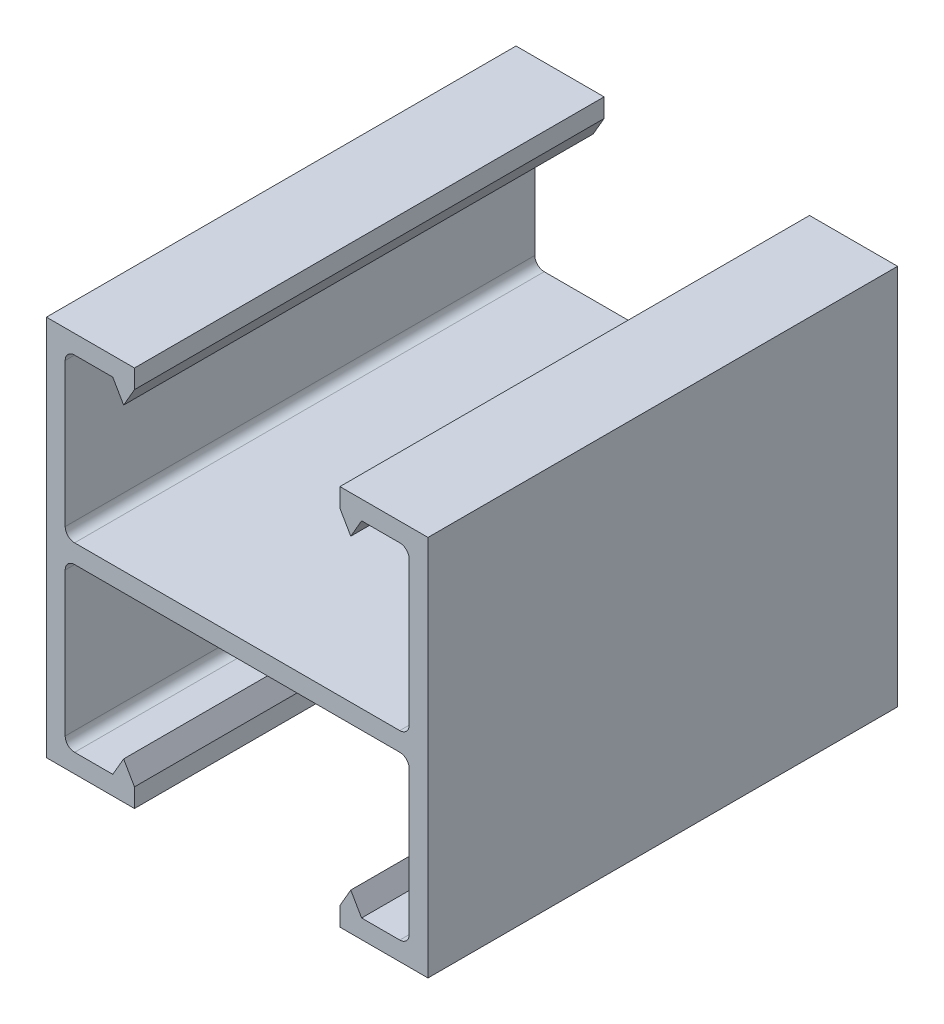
from build123d import *

# Parameters (mm, degrees)
BASE_EXTRUDE_DEPTH = 12.7


with BuildPart() as part:
    # Sketch1 → Base-Extrude (new, symmetric)
    with BuildSketch(Plane.XY):
        with BuildLine():
            Line((-5.55625, 10.31875), (-10.31875, 10.31875))
            Line((-10.31875, 10.31875), (-10.31875, -10.31875))
            Line((-10.31875, -10.31875), (-5.55625, -10.31875))
            Line((-5.55625, -10.31875), (-5.55625, -9.30275))
            Line((-5.55625, -9.30275), (-6.142837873, -8.28675))
            Line((-6.142837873, -8.28675), (-6.729425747, -9.30275))
            Line((-6.729425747, -9.30275), (-8.79475, -9.30275))
            ThreePointArc((-8.79475, -9.30275), (-9.153960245, -9.153960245), (-9.30275, -8.79475))
            Line((-9.30275, -8.79475), (-9.30275, -1.016))
            ThreePointArc((-9.30275, -1.016), (-9.153960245, -0.656789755), (-8.79475, -0.508))
            Line((-8.79475, -0.508), (8.79475, -0.508))
            ThreePointArc((8.79475, -0.508), (9.153960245, -0.656789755), (9.30275, -1.016))
            Line((9.30275, -1.016), (9.30275, -8.79475))
            ThreePointArc((9.30275, -8.79475), (9.153960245, -9.153960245), (8.79475, -9.30275))
            Line((8.79475, -9.30275), (6.729425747, -9.30275))
            Line((6.729425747, -9.30275), (6.142837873, -8.28675))
            Line((6.142837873, -8.28675), (5.55625, -9.30275))
            Line((5.55625, -9.30275), (5.55625, -10.31875))
            Line((5.55625, -10.31875), (10.31875, -10.31875))
            Line((10.31875, -10.31875), (10.31875, 10.31875))
            Line((10.31875, 10.31875), (5.55625, 10.31875))
            Line((5.55625, 10.31875), (5.55625, 9.30275))
            Line((5.55625, 9.30275), (6.142837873, 8.28675))
            Line((6.142837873, 8.28675), (6.729425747, 9.30275))
            Line((6.729425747, 9.30275), (8.79475, 9.30275))
            ThreePointArc((8.79475, 9.30275), (9.153960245, 9.153960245), (9.30275, 8.79475))
            Line((9.30275, 8.79475), (9.30275, 1.016))
            ThreePointArc((9.30275, 1.016), (9.153960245, 0.656789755), (8.79475, 0.508))
            Line((8.79475, 0.508), (-8.79475, 0.508))
            ThreePointArc((-8.79475, 0.508), (-9.153960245, 0.656789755), (-9.30275, 1.016))
            Line((-9.30275, 1.016), (-9.30275, 8.79475))
            ThreePointArc((-9.30275, 8.79475), (-9.153960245, 9.153960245), (-8.79475, 9.30275))
            Line((-8.79475, 9.30275), (-6.729425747, 9.30275))
            Line((-6.729425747, 9.30275), (-6.142837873, 8.28675))
            Line((-6.142837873, 8.28675), (-5.55625, 9.30275))
            Line((-5.55625, 9.30275), (-5.55625, 10.31875))
        make_face()
    extrude(amount=BASE_EXTRUDE_DEPTH, both=True)


solid = part.part
